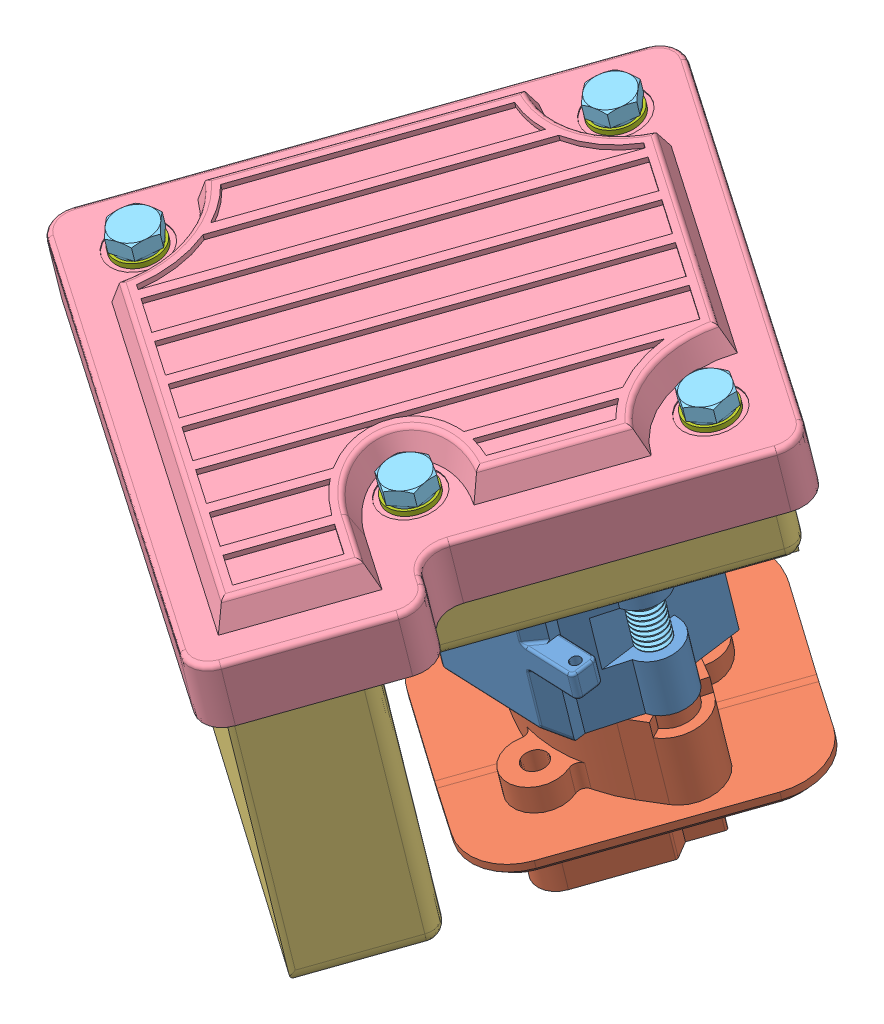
SolidWorks assembly Carbu + adaptateur.SLDASM, configuration Défaut (file format 11000). Lengths in mm.
Overall size (137.5 108.39 144.15).
17 component instances, 7 part files, 31 mates.
Components (placement in the parent):
- Carburateur-1: Carburateur.SLDPRT [Défaut] at (-21.6554 -49.1303 84.3435) x (0.997602 0.023956 0.064935) z (-0.037493 0.975658 0.216067) size (40 35 28.5)
- Essai 2 adaptateur-1: Essai 2 adaptateur.SLDPRT [Défaut] at (-37.7309 -73.3035 42.6068) x (0.551813 0.200478 -0.809513) z (-0.037493 0.975658 0.216067) size (56 47 32.02)
- Assemblage filtre-1: Assemblage filtre.SLDASM [Défaut] at (-11.5497 -122.4106 43.4626) x (-0.551813 -0.200478 0.809513) z (-0.037493 0.975658 0.216067) size (94 102 119.83)
  - FIltre bas-1: FIltre bas.SLDPRT [Défaut] at (-29.8045 -46.3653 121.2084) size (90 98 56.42)
  - Filtre haut-1: Filtre haut.SLDPRT [Défaut] at (-29.8045 -46.3653 122.2084) size (94 102 17.41)
- hex bolt gradeab_iso-1: hex bolt gradeab_iso.sldprt [ISO 4014 - M6 x 45 x 45-S] at (9.4789 -57.2858 71.0339) x (-0.037493 0.975658 0.216067) z (-0.955492 0.028314 -0.293656) size (49 11.55 10)
- hex bolt gradeab_iso-2: hex bolt gradeab_iso.sldprt [ISO 4014 - M6 x 45 x 45-S] at (-20.4492 -58.0044 69.0859) x (-0.037493 0.975658 0.216067) z (-0.963443 0.022106 -0.267) size (49 11.55 10)
- hex nut gradec_iso-1: hex nut gradec_iso.sldprt [ISO - 4034 - M6 - S] at (7.6942 -10.8444 81.3188) x (0.459362 0.208848 -0.863348) z (-0.037493 0.975658 0.216067) size (10 11.55 6.1)
- hex nut gradec_iso-2: hex nut gradec_iso.sldprt [ISO - 4034 - M6 - S] at (-22.2339 -11.5631 79.3707) x (0.152784 0.219274 -0.963626) z (-0.037493 0.975658 0.216067) size (10 11.55 6.1)
- plain washer 10673 type snl_iso-1: plain washer 10673 type snl_iso.sldprt [ISO 10673-4.55-S] at (19.6082 9.0449 75.2629) x (-0.037493 0.975658 0.216067) z (-0.26463 -0.218194 0.939341) size (1 9 9)
- plain washer 10673 type snl_iso-2: plain washer 10673 type snl_iso.sldprt [ISO 10673-4.55-S] at (-4.709 1.1995 111.0976) x (0.037493 -0.975658 -0.216067) z (0.295141 -0.195762 0.935184) size (1 9 9)
- plain washer 10673 type snl_iso-3: plain washer 10673 type snl_iso.sldprt [ISO 10673-4.55-S] at (-74.0049 0.8773 95.8996) x (-0.037493 0.975658 0.216067) z (-0.079482 -0.218446 0.972607) size (1 9 9)
- plain washer 10673 type snl_iso-4: plain washer 10673 type snl_iso.sldprt [ISO 10673-4.55-S] at (-35.378 14.9108 39.2337) x (-0.037493 0.975658 0.216067) z (-0.174511 -0.21929 0.959926) size (1 9 9)
- hex bolt gradeab_iso-7: hex bolt gradeab_iso.sldprt [ISO 4014 - M5 x 25 x 25-S] at (19.4395 13.4353 76.2353) x (0.037493 -0.975658 -0.216067) z (0.474946 -0.172839 0.862875) size (28.5 9.24 8)
- hex bolt gradeab_iso-8: hex bolt gradeab_iso.sldprt [ISO 4014 - M5 x 25 x 25-S] at (-4.8403 4.6143 111.8538) x (0.037493 -0.975658 -0.216067) z (0.488857 -0.170673 0.855505) size (28.5 9.24 8)
- hex bolt gradeab_iso-9: hex bolt gradeab_iso.sldprt [ISO 4014 - M5 x 25 x 25-S] at (-35.5467 19.3013 40.206) x (0.037493 -0.975658 -0.216067) z (-0.927926 0.046255 -0.369883) size (28.5 9.24 8)
- hex bolt gradeab_iso-10: hex bolt gradeab_iso.sldprt [ISO 4014 - M5 x 25 x 25-S] at (-74.1736 5.2678 96.8719) x (0.037493 -0.975658 -0.216067) z (0.193058 -0.205074 0.959517) size (28.5 9.24 8)
Mates (geometry in assembly coordinates):
- Coïncidente2: coincident: plane of Carburateur-1 through (9.0289 -45.5779 73.6268) normal (0.037493 -0.975658 -0.216067); plane of Essai 2 adaptateur-1 through (-20.8991 -46.2965 71.6787) normal (-0.037493 0.975658 0.216067)
- Coaxiale3: concentric: cylinder of Carburateur-1 through (7.9604 -17.7716 79.7847) axis (0.037493 -0.975658 -0.216067) radius 3; cylinder of Essai 2 adaptateur-1 through (10.2288 -76.8009 66.7122) axis (-0.037493 0.975658 0.216067) radius 2.5
- Coaxiale4: concentric: cylinder of Carburateur-1 through (-21.9677 -18.4903 77.8366) axis (0.037493 -0.975658 -0.216067) radius 3; cylinder of Essai 2 adaptateur-1 through (-19.6993 -77.5196 64.7641) axis (-0.037493 0.975658 0.216067) radius 2.5
- Coïncidente3: coincident: plane of Carburateur-1 through (7.9604 -17.7716 79.7847) normal (-0.037493 0.975658 0.216067); plane of Assemblage filtre-1/FIltre bas-1 through (-37.8258 -5.7645 17.6211) normal (0.037493 -0.975658 -0.216067)
- Parallèle2: parallel: line of Essai 2 adaptateur-1 through (21.7559 -63.3214 63.3931) axis (-0.551813 -0.200478 0.809513); line of Assemblage filtre-1/FIltre bas-1 through (27.4609 -14.5447 68.5972) axis (-0.551813 -0.200478 0.809513)
- Distance1: distance = 12 mm: point of Carburateur-1; plane of Assemblage filtre-1/Filtre haut-1 through (36.2181 10.628 72.1536) normal (0.833125 -0.088878 0.545897)
- Distance2: distance = 15 mm: point of Carburateur-1; plane of Assemblage filtre-1/Filtre haut-1 through (-38.7631 18.627 23.0228) normal (0.551813 0.200478 -0.809513)
- Coaxiale248: concentric: cylinder of Carburateur-1 through (7.9604 -17.7716 79.7847) axis (0.037493 -0.975658 -0.216067) radius 3; cylinder of hex bolt gradeab_iso-1 through (9.4789 -57.2858 71.0339) axis (0.037493 -0.975658 -0.216067) radius 5
- Coaxiale249: concentric: cylinder of Carburateur-1 through (-21.9677 -18.4903 77.8366) axis (0.037493 -0.975658 -0.216067) radius 3; cylinder of hex bolt gradeab_iso-2 through (-20.4492 -58.0044 69.0859) axis (0.037493 -0.975658 -0.216067) radius 5
- Coïncidente448: coincident: plane of Essai 2 adaptateur-1 through (-38.6307 -49.8877 47.7924) normal (0.037493 -0.975658 -0.216067); plane of hex bolt gradeab_iso-1 through (11.0184 -52.1276 66.5221) normal (-0.037493 0.975658 0.216067)
- Coïncidente449: coincident: plane of Essai 2 adaptateur-1 through (-38.6307 -49.8877 47.7924) normal (0.037493 -0.975658 -0.216067); plane of hex bolt gradeab_iso-2 through (-19.0676 -52.8422 64.5279) normal (-0.037493 0.975658 0.216067)
- Coaxiale250: concentric: circle of hex bolt gradeab_iso-2; circle of hex nut gradec_iso-2
- Coaxiale251: concentric: circle of hex bolt gradeab_iso-1; circle of hex nut gradec_iso-1
- Coïncidente450: coincident: plane of Assemblage filtre-1/FIltre bas-1 through (-37.8633 -4.7888 17.8372) normal (-0.037493 0.975658 0.216067); plane of hex nut gradec_iso-1 through (2.7992 -16.4098 77.368) normal (0.037493 -0.975658 -0.216067)
- Coïncidente451: coincident: plane of Assemblage filtre-1/FIltre bas-1 through (-37.8633 -4.7888 17.8372) normal (-0.037493 0.975658 0.216067); plane of hex nut gradec_iso-2 through (-27.7068 -17.5326 77.1446) normal (0.037493 -0.975658 -0.216067)
- Coaxiale252: concentric: cylinder of Assemblage filtre-1/Filtre haut-1 through (20.0488 -2.4201 72.7239) axis (-0.037493 0.975658 0.216067) radius 2.5; cylinder of plain washer 10673 type snl_iso-1 through (19.5707 10.0205 75.479) axis (0.037493 -0.975658 -0.216067) radius 2.275
- Coïncidente452: coincident: plane of Assemblage filtre-1/Filtre haut-1 through (19.6082 9.0449 75.2629) normal (-0.037493 0.975658 0.216067); plane of plain washer 10673 type snl_iso-1 through (19.6082 9.0449 75.2629) normal (0.037493 -0.975658 -0.216067)
- Coïncidente453: coincident: plane of Assemblage filtre-1/Filtre haut-1 through (-4.6715 0.2238 110.8815) normal (-0.037493 0.975658 0.216067); plane of plain washer 10673 type snl_iso-2 through (-4.6715 0.2238 110.8815) normal (0.037493 -0.975658 -0.216067)
- Coïncidente454: coincident: circle of Assemblage filtre-1/Filtre haut-1; plane of plain washer 10673 type snl_iso-4 through (-35.378 14.9108 39.2337) normal (0.037493 -0.975658 -0.216067)
- Coïncidente455: coincident: plane of Assemblage filtre-1/Filtre haut-1 through (-74.0049 0.8773 95.8996) normal (-0.037493 0.975658 0.216067); plane of plain washer 10673 type snl_iso-3 through (-74.0049 0.8773 95.8996) normal (0.037493 -0.975658 -0.216067)
- Coaxiale253: concentric: cylinder of Assemblage filtre-1/Filtre haut-1 through (-73.5643 -10.5877 93.3606) axis (-0.037493 0.975658 0.216067) radius 2.5; cylinder of plain washer 10673 type snl_iso-3 through (-74.0424 1.853 96.1157) axis (0.037493 -0.975658 -0.216067) radius 2.275
- Coaxiale254: concentric: cylinder of Assemblage filtre-1/Filtre haut-1 through (-34.9374 3.4458 36.6947) axis (-0.037493 0.975658 0.216067) radius 2.5; cylinder of plain washer 10673 type snl_iso-4 through (-35.4155 15.8864 39.4498) axis (0.037493 -0.975658 -0.216067) radius 2.275
- Coaxiale255: concentric: cylinder of Assemblage filtre-1/Filtre haut-1 through (-4.231 -11.2412 108.3425) axis (-0.037493 0.975658 0.216067) radius 2.5; cylinder of plain washer 10673 type snl_iso-2 through (-4.6715 0.2238 110.8815) axis (-0.037493 0.975658 0.216067) radius 2.275
- Coïncidente456: coincident: plane of plain washer 10673 type snl_iso-1 through (19.5707 10.0205 75.479) normal (-0.037493 0.975658 0.216067); plane of hex bolt gradeab_iso-7 through (23.6317 10.6439 73.3687) normal (0.037493 -0.975658 -0.216067)
- Coïncidente457: coincident: plane of plain washer 10673 type snl_iso-2 through (-4.709 1.1995 111.0976) normal (-0.037493 0.975658 0.216067); plane of hex bolt gradeab_iso-8 through (-0.6835 1.8355 108.9242) normal (0.037493 -0.975658 -0.216067)
- Coïncidente458: coincident: plane of plain washer 10673 type snl_iso-4 through (-35.4155 15.8864 39.4498) normal (-0.037493 0.975658 0.216067); plane of hex bolt gradeab_iso-9 through (-37.1285 14.8964 43.6234) normal (0.037493 -0.975658 -0.216067)
- Coïncidente459: coincident: plane of plain washer 10673 type snl_iso-3 through (-74.0424 1.853 96.1157) normal (-0.037493 0.975658 0.216067); plane of hex bolt gradeab_iso-10 through (-69.5138 2.2118 95.2812) normal (0.037493 -0.975658 -0.216067)
- Coaxiale257: concentric: cylinder of Assemblage filtre-1/Filtre haut-1 through (-73.5643 -10.5877 93.3606) axis (-0.037493 0.975658 0.216067) radius 2.5; cylinder of hex bolt gradeab_iso-10 through (-74.1736 5.2678 96.8719) axis (-0.037493 0.975658 0.216067) radius 4
- Coaxiale258: concentric: cylinder of Assemblage filtre-1/Filtre haut-1 through (20.0488 -2.4201 72.7239) axis (-0.037493 0.975658 0.216067) radius 2.5; cylinder of hex bolt gradeab_iso-7 through (19.4395 13.4353 76.2353) axis (-0.037493 0.975658 0.216067) radius 4
- Coaxiale259: concentric: cylinder of Assemblage filtre-1/Filtre haut-1 through (-34.9374 3.4458 36.6947) axis (-0.037493 0.975658 0.216067) radius 2.5; cylinder of hex bolt gradeab_iso-9 through (-35.5467 19.3013 40.206) axis (-0.037493 0.975658 0.216067) radius 4
- Coaxiale260: concentric: cylinder of Assemblage filtre-1/Filtre haut-1 through (-4.231 -11.2412 108.3425) axis (-0.037493 0.975658 0.216067) radius 2.5; cylinder of hex bolt gradeab_iso-8 through (-4.8403 4.6143 111.8538) axis (-0.037493 0.975658 0.216067) radius 4
